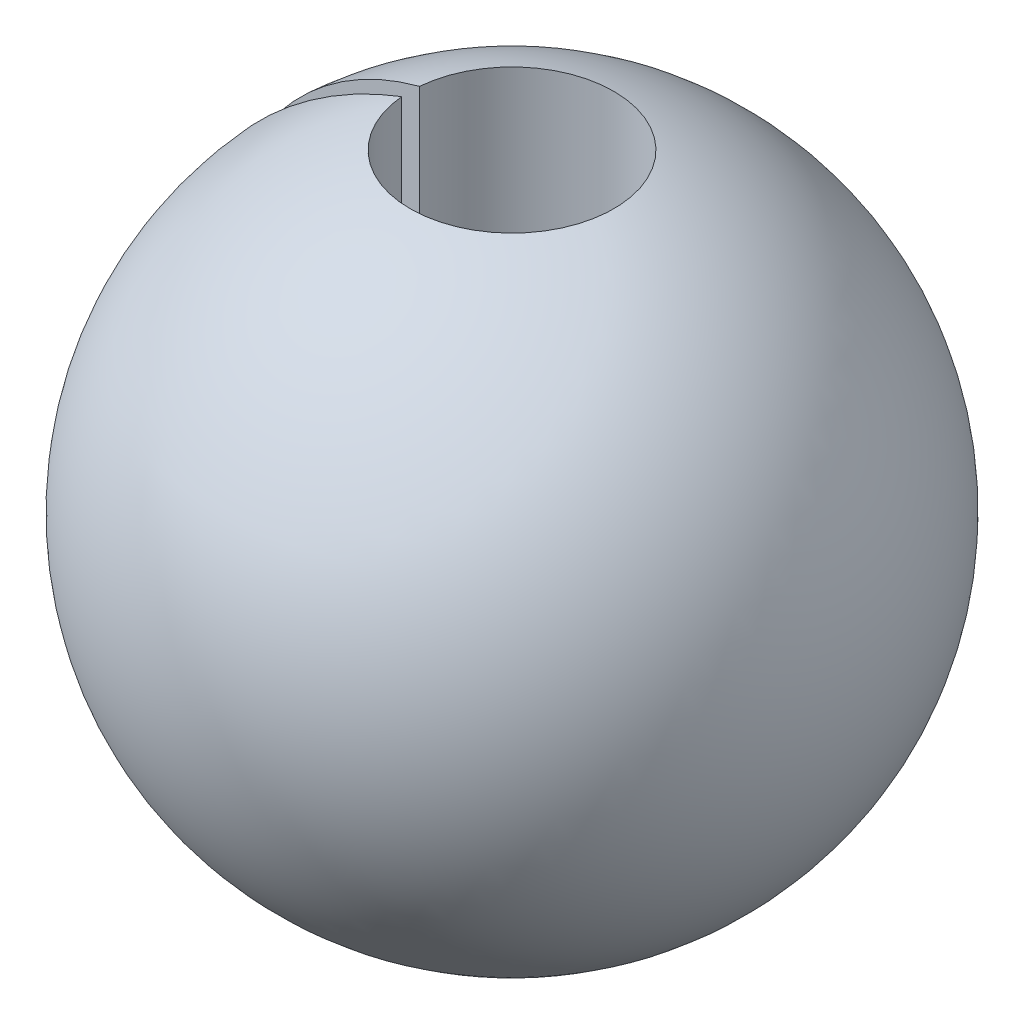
ISO-10303-21;
HEADER;
FILE_DESCRIPTION(('STEP AP214'),'2;1');
FILE_NAME('part.step','',(''),(''),'','','');
FILE_SCHEMA(('AUTOMOTIVE_DESIGN { 1 0 10303 214 1 1 1 1 }'));
ENDSEC;
DATA;
#1=APPLICATION_CONTEXT('core data for automotive mechanical design processes');
#2=APPLICATION_PROTOCOL_DEFINITION('international standard','automotive_design',2000,#1);
#3=PRODUCT_CONTEXT('',#1,'mechanical');
#4=PRODUCT('Part','Part','',(#3));
#5=PRODUCT_RELATED_PRODUCT_CATEGORY('part','',(#4));
#6=PRODUCT_DEFINITION_FORMATION('','',#4);
#7=PRODUCT_DEFINITION_CONTEXT('part definition',#1,'design');
#8=PRODUCT_DEFINITION('design','',#6,#7);
#9=PRODUCT_DEFINITION_SHAPE('','',#8);
#10=(LENGTH_UNIT() NAMED_UNIT(*) SI_UNIT(.MILLI.,.METRE.));
#11=(NAMED_UNIT(*) PLANE_ANGLE_UNIT() SI_UNIT($,.RADIAN.));
#12=(NAMED_UNIT(*) SI_UNIT($,.STERADIAN.) SOLID_ANGLE_UNIT());
#13=UNCERTAINTY_MEASURE_WITH_UNIT(LENGTH_MEASURE(1.E-05),#10,'distance_accuracy_value','');
#14=(GEOMETRIC_REPRESENTATION_CONTEXT(3) GLOBAL_UNCERTAINTY_ASSIGNED_CONTEXT((#13)) GLOBAL_UNIT_ASSIGNED_CONTEXT((#10,
#11,#12)) REPRESENTATION_CONTEXT('',''));
#15=CARTESIAN_POINT('',(0.,0.,0.));
#16=DIRECTION('',(0.,0.,1.));
#17=DIRECTION('',(1.,0.,0.));
#18=AXIS2_PLACEMENT_3D('',#15,#16,#17);
#19=CARTESIAN_POINT('',(0.,0.,0.));
#20=DIRECTION('',(0.,-1.,0.));
#21=DIRECTION('',(0.,0.,1.));
#22=AXIS2_PLACEMENT_3D('',#19,#20,#21);
#23=SPHERICAL_SURFACE('',#22,654.);
#24=CARTESIAN_POINT('',(0.,622.022507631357,2.17177997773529E-12));
#25=DIRECTION('',(0.,-1.,0.));
#26=DIRECTION('',(0.,0.,-1.));
#27=AXIS2_PLACEMENT_3D('',#24,#25,#26);
#28=CIRCLE('',#27,201.999999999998);
#29=CARTESIAN_POINT('',(-201.231329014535,622.022507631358,-17.6054600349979));
#30=VERTEX_POINT('',#29);
#31=CARTESIAN_POINT('',(-201.231329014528,622.022507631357,17.6054600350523));
#32=VERTEX_POINT('',#31);
#33=EDGE_CURVE('E66',#30,#32,#28,.T.);
#34=ORIENTED_EDGE('',*,*,#33,.T.);
#35=CARTESIAN_POINT('',(1.87476980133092E-13,0.,2.14287168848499E-12));
#36=DIRECTION('',(0.0871557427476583,0.,0.996194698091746));
#37=DIRECTION('',(0.996194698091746,0.,-0.0871557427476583));
#38=AXIS2_PLACEMENT_3D('',#35,#36,#37);
#39=CIRCLE('',#38,654.);
#40=CARTESIAN_POINT('',(-201.23132901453,-622.022507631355,17.6054600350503));
#41=VERTEX_POINT('',#40);
#42=EDGE_CURVE('E54',#32,#41,#39,.T.);
#43=ORIENTED_EDGE('',*,*,#42,.T.);
#44=CARTESIAN_POINT('',(0.,-622.022507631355,-2.17177997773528E-12));
#45=DIRECTION('',(0.,-1.,0.));
#46=DIRECTION('',(0.,0.,-1.));
#47=AXIS2_PLACEMENT_3D('',#44,#45,#46);
#48=CIRCLE('',#47,202.000000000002);
#49=CARTESIAN_POINT('',(-201.231329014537,-622.022507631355,-17.6054600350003));
#50=VERTEX_POINT('',#49);
#51=EDGE_CURVE('E63',#50,#41,#48,.T.);
#52=ORIENTED_EDGE('',*,*,#51,.F.);
#53=CARTESIAN_POINT('',(-1.88562817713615E-13,0.,2.15528286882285E-12));
#54=DIRECTION('',(0.0871557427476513,0.,-0.996194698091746));
#55=DIRECTION('',(-0.996194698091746,0.,-0.0871557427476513));
#56=AXIS2_PLACEMENT_3D('',#53,#54,#55);
#57=CIRCLE('',#56,654.);
#58=EDGE_CURVE('E47',#50,#30,#57,.T.);
#59=ORIENTED_EDGE('',*,*,#58,.T.);
#60=EDGE_LOOP('',(#34,#43,#52,#59));
#61=FACE_BOUND('',#60,.T.);
#62=ADVANCED_FACE('F34',(#61),#23,.T.);
#63=CARTESIAN_POINT('',(0.,-6735.65751072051,-2.35174225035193E-11));
#64=DIRECTION('',(0.,-1.,0.));
#65=DIRECTION('',(0.,0.,-1.));
#66=AXIS2_PLACEMENT_3D('',#63,#64,#65);
#67=CYLINDRICAL_SURFACE('',#66,202.);
#68=ORIENTED_EDGE('',*,*,#51,.T.);
#69=DIRECTION('',(0.,-1.,0.));
#70=VECTOR('',#69,1.);
#71=CARTESIAN_POINT('',(-201.23132901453,-6735.65751072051,17.6054600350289));
#72=LINE('',#71,#70);
#73=EDGE_CURVE('E11',#41,#32,#72,.F.);
#74=ORIENTED_EDGE('',*,*,#73,.T.);
#75=ORIENTED_EDGE('',*,*,#33,.F.);
#76=DIRECTION('',(0.,-1.,0.));
#77=VECTOR('',#76,1.);
#78=CARTESIAN_POINT('',(-201.231329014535,-6735.65751072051,-17.6054600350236));
#79=LINE('',#78,#77);
#80=EDGE_CURVE('E41',#30,#50,#79,.T.);
#81=ORIENTED_EDGE('',*,*,#80,.T.);
#82=EDGE_LOOP('',(#68,#74,#75,#81));
#83=FACE_BOUND('',#82,.T.);
#84=ADVANCED_FACE('F68',(#83),#67,.F.);
#85=CARTESIAN_POINT('',(0.,-1007.,2.17177997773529E-12));
#86=DIRECTION('',(0.0871557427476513,0.,-0.996194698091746));
#87=DIRECTION('',(-0.996194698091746,0.,-0.0871557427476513));
#88=AXIS2_PLACEMENT_3D('',#85,#86,#87);
#89=PLANE('',#88);
#90=ORIENTED_EDGE('',*,*,#80,.F.);
#91=ORIENTED_EDGE('',*,*,#58,.F.);
#92=EDGE_LOOP('',(#90,#91));
#93=FACE_BOUND('',#92,.T.);
#94=ADVANCED_FACE('F58',(#93),#89,.F.);
#95=CARTESIAN_POINT('',(-823.992991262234,-1007.,72.0900455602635));
#96=DIRECTION('',(0.0871557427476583,0.,0.996194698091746));
#97=DIRECTION('',(0.996194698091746,0.,-0.0871557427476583));
#98=AXIS2_PLACEMENT_3D('',#95,#96,#97);
#99=PLANE('',#98);
#100=ORIENTED_EDGE('',*,*,#73,.F.);
#101=ORIENTED_EDGE('',*,*,#42,.F.);
#102=EDGE_LOOP('',(#100,#101));
#103=FACE_BOUND('',#102,.T.);
#104=ADVANCED_FACE('F72',(#103),#99,.F.);
#105=CLOSED_SHELL('',(#62,#84,#94,#104));
#106=MANIFOLD_SOLID_BREP('B2',#105);
#107=ADVANCED_BREP_SHAPE_REPRESENTATION('',(#18,#106),#14);
#108=SHAPE_DEFINITION_REPRESENTATION(#9,#107);
ENDSEC;
END-ISO-10303-21;
